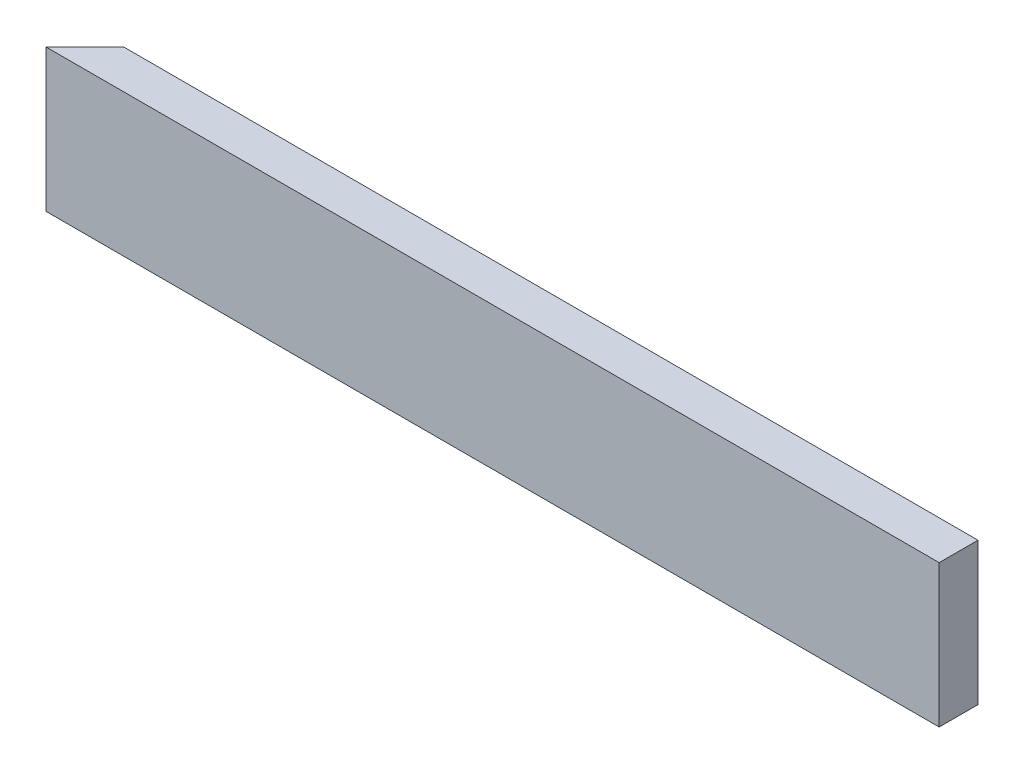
from build123d import *

# Parameters (mm, degrees)
BOSS_EXTRUDE1_DEPTH = 139.7


with BuildPart() as part:
    # Sketch2 → Boss-Extrude1 (new body)
    with BuildSketch(Plane(origin=(0, 0, 0), x_dir=(1, 0, 0), z_dir=(0, 1, 0))):
        Polygon((0, 0), (0, -38.1), (-876.3, -38.1), (-838.2, 0), align=None)
    extrude(amount=BOSS_EXTRUDE1_DEPTH)


solid = part.part
